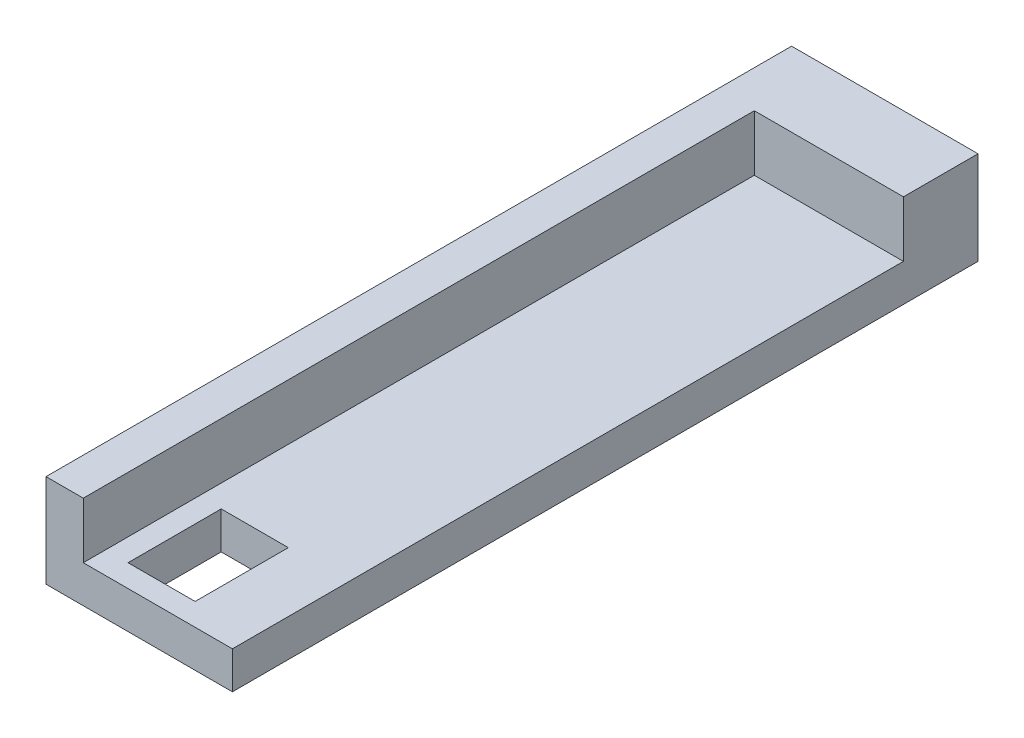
from build123d import *

# Parameters (mm, degrees)
SKETCH1_W                 = 50
SKETCH1_H                 = 25
BOSS_EXTRUDE1_DEPTH       = 200
SHELL1_T                  = -10
SHELL1_THICKNESS_2_FACE_W = 40
SHELL1_THICKNESS_2_FACE_H = 15
SHELL1_THICKNESS_2_DEPTH  = 10
SKETCH2_W                 = 18
SKETCH2_H                 = 25
CUT_EXTRUDE1_DEPTH        = 207.700266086


with BuildPart() as part:
    # Sketch1 → Boss-Extrude1 (new body)
    with BuildSketch(Plane.XY):
        with Locations((25, 12.5)):
            Rectangle(SKETCH1_W, SKETCH1_H)
    extrude(amount=BOSS_EXTRUDE1_DEPTH)

    # Shell1
    shell1_openings = [part.faces().sort_by_distance(p)[0] for p in [
        (25, 12.5, 200),
        (25, 25, 100),
        (50, 12.5, 100),
    ]]
    offset(amount=SHELL1_T, openings=shell1_openings, kind=Kind.INTERSECTION)

    # Shell1 thickness 2 face (on inner face of the shell) → Shell1 thickness 2 (add)
    with BuildSketch(Plane(origin=(30, 17.5, 10), x_dir=(-1, 0, 0), z_dir=(0, 0, -1))):
        Rectangle(SHELL1_THICKNESS_2_FACE_W, SHELL1_THICKNESS_2_FACE_H)
    extrude(amount=-SHELL1_THICKNESS_2_DEPTH)

    # Sketch2 → Cut-Extrude1 (cut, through all)
    with BuildSketch(Plane(origin=(0, 10, 0), x_dir=(1, 0, 0), z_dir=(0, 1, 0))):
        with Locations((25, -181.5)):
            Rectangle(SKETCH2_W, SKETCH2_H)
    extrude(amount=-CUT_EXTRUDE1_DEPTH, mode=Mode.SUBTRACT)


solid = part.part
